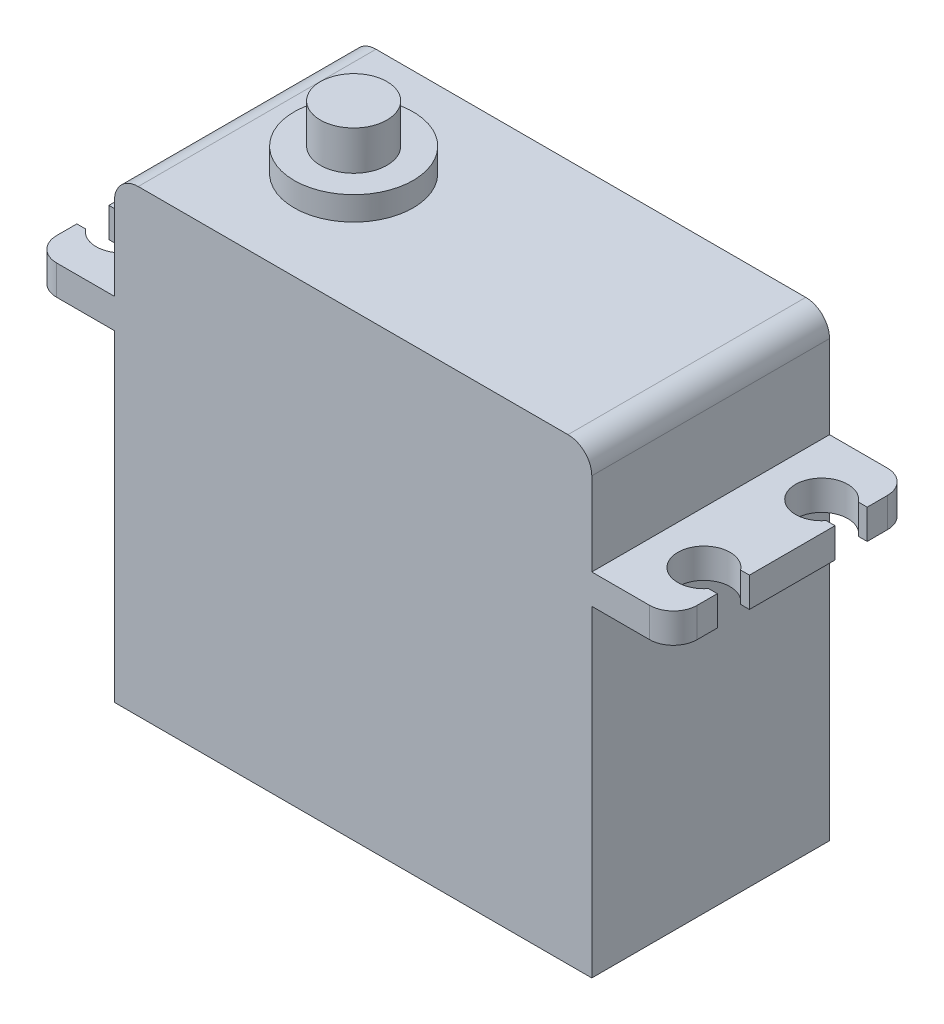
from build123d import *

# Parameters (mm, degrees)
SKETCH1_W            = 40.132
SKETCH1_H            = 19.9898
BOSS_EXTRUDE1_DEPTH  = 40.5638
SKETCH2_W            = 6.858
SKETCH2_H            = 19.9898
BOSS_EXTRUDE2_DEPTH  = 2.5
CUT_EXTRUDE1_DEPTH   = 2.5
MIRROR2_COPY_1_DEPTH = 2.5
SKETCH4_R            = 2.8
BOSS_EXTRUDE3_DEPTH  = 3.3
SKETCH5_W            = 40.132
SKETCH5_H            = 19.9898
SKETCH5_R            = 5
CUT_EXTRUDE2_DEPTH   = 2
FILLET1_R            = 2


with BuildPart() as part:
    # Sketch1 → Boss-Extrude1 (new body)
    with BuildSketch(Plane(origin=(0, 0, 0), x_dir=(1, 0, 0), z_dir=(0, 1, 0))):
        Rectangle(SKETCH1_W, SKETCH1_H)
    extrude(amount=BOSS_EXTRUDE1_DEPTH)

    # Sketch2 → Boss-Extrude2 (add)
    with BuildSketch(Plane(origin=(0, 29.5656, 0), x_dir=(1, 0, 0), z_dir=(0, 1, 0))):
        with Locations((23.495, 0)):
            Rectangle(SKETCH2_W, SKETCH2_H)
    boss_extrude2 = extrude(amount=-BOSS_EXTRUDE2_DEPTH)

    # Sketch3 → Cut-Extrude1 (cut)
    with BuildSketch(Plane(origin=(0, 29.5656, 0), x_dir=(1, 0, 0), z_dir=(0, 1, 0))):
        with BuildLine():
            Line((26.187095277, 6.3), (26.924, 6.3))
            Line((26.924, 6.3), (26.924, 3.6))
            Line((26.924, 3.6), (26.187095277, 3.6))
            ThreePointArc((26.187095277, 3.6), (22.25, 4.95), (26.187095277, 6.3))
        make_face()
    cut_extrude1 = extrude(amount=-CUT_EXTRUDE1_DEPTH, mode=Mode.SUBTRACT)

    # Mirror1: Cut-Extrude1 across plane
    add(cut_extrude1.mirror(Plane.XY), mode=Mode.SUBTRACT)

    # Mirror2: Boss-Extrude2, Cut-Extrude1 across plane
    add(boss_extrude2.mirror(Plane(origin=(0, 0, 0), x_dir=(0, 0, 1), z_dir=(1, 0, 0))))
    add(cut_extrude1.mirror(Plane(origin=(0, 0, 0), x_dir=(0, 0, 1), z_dir=(1, 0, 0))), mode=Mode.SUBTRACT)

    # Mirror2 copy 1 sketch → Mirror2 copy 1 (cut)
    with BuildSketch(Plane(origin=(0, 29.5656, 0), x_dir=(-1, 0, 0), z_dir=(0, 1, 0))):
        with BuildLine():
            Line((26.187095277, 6.3), (26.924, 6.3))
            Line((26.924, 6.3), (26.924, 3.6))
            Line((26.924, 3.6), (26.187095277, 3.6))
            ThreePointArc((26.187095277, 3.6), (22.25, 4.95), (26.187095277, 6.3))
        make_face()
    extrude(amount=-MIRROR2_COPY_1_DEPTH, mode=Mode.SUBTRACT)

    # Sketch4 → Boss-Extrude3 (add)
    with BuildSketch(Plane(origin=(0, 40.5638, 0), x_dir=(1, 0, 0), z_dir=(0, 1, 0))):
        with Locations(Location((-9.95, 0, 0), (0, 0, 90))):
            Circle(SKETCH4_R)
    extrude(amount=BOSS_EXTRUDE3_DEPTH)

    # Sketch5 → Cut-Extrude2 (cut)
    with BuildSketch(Plane(origin=(0, 40.5638, 0), x_dir=(1, 0, 0), z_dir=(0, 1, 0))):
        Rectangle(SKETCH5_W, SKETCH5_H)
        with Locations(Location((-9.95, 0, 0), (0, 0, 270))):
            Circle(SKETCH5_R, mode=Mode.SUBTRACT)
    extrude(amount=-CUT_EXTRUDE2_DEPTH, mode=Mode.SUBTRACT)

    # Fillet1
    fillet1_edges = [part.edges().sort_by_distance(p)[0] for p in [
        (-20.066, 38.5638, 0),
        (20.066, 38.5638, 0),
        (26.924, 28.3156, -9.9949),
        (26.924, 28.3156, 9.9949),
        (-26.924, 28.3156, 9.9949),
        (-26.924, 28.3156, -9.9949),
    ]]
    fillet(fillet1_edges, radius=FILLET1_R)


solid = part.part
